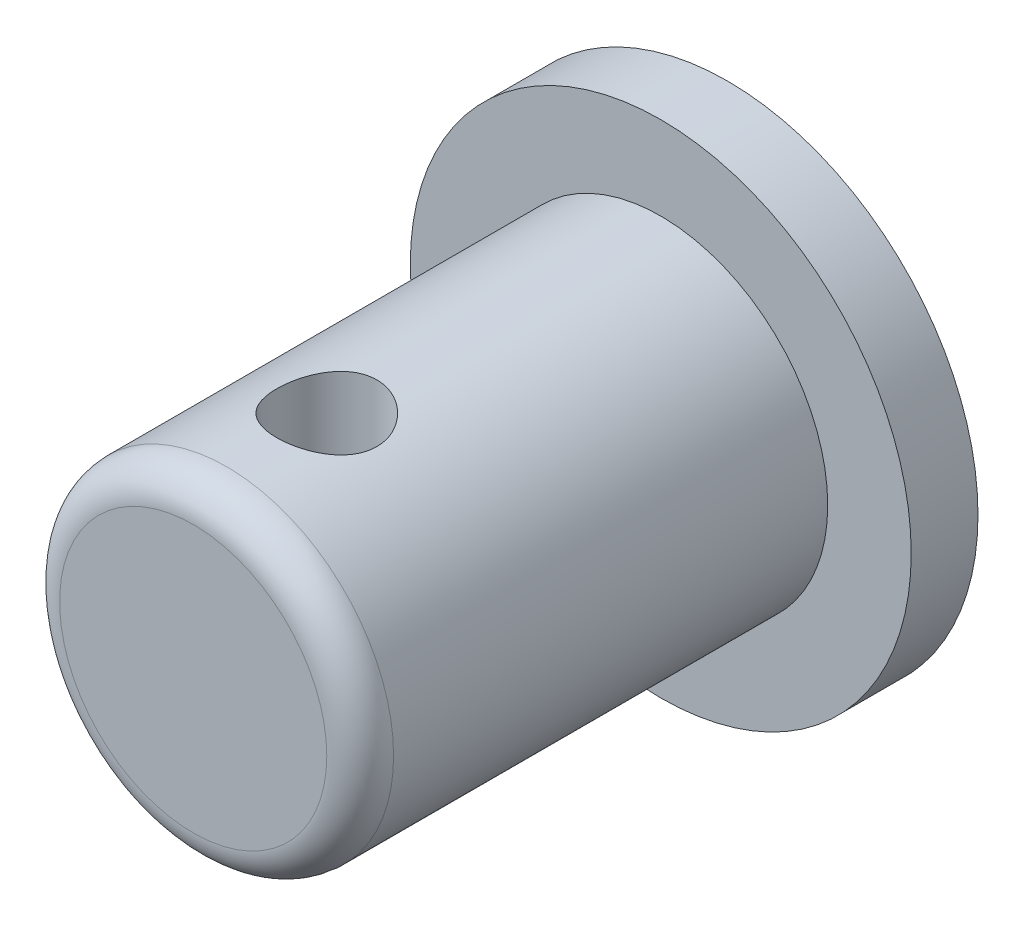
from build123d import *

# Parameters (mm, degrees)
ESQUISSE2_R             = 3.75
BASE_EXTRUSION_DEPTH    = 1
ESQUISSE3_R             = 2.5
BOSS_EXTRU_1_DEPTH      = 7
CONG_1_R                = 0.5
ESQUISSE4_R             = 0.75
ENL_V_MAT_EXTRU_1_DEPTH = 4


with BuildPart() as part:
    # Esquisse2 → Base-Extrusion (new body)
    with BuildSketch(Plane.XY):
        Circle(ESQUISSE2_R)
    extrude(amount=BASE_EXTRUSION_DEPTH)

    # Esquisse3 → Boss.-Extru.1 (add)
    with BuildSketch(Plane.XY.offset(1)):
        Circle(ESQUISSE3_R)
    extrude(amount=BOSS_EXTRU_1_DEPTH)

    # Cong_1
    cong_1_edges = [part.edges().sort_by_distance(p)[0] for p in [
        (-2.5, 0, 8),
    ]]
    fillet(cong_1_edges, radius=CONG_1_R)

    # Esquisse4 → Enl_v. mat.-Extru.1 (cut, symmetric)
    with BuildSketch(Plane(origin=(0, 0, 0), x_dir=(1, 0, 0), z_dir=(0, 1, 0))):
        with Locations(Location((0, -6, 0), (0, 0, 270))):
            Circle(ESQUISSE4_R)
    extrude(amount=ENL_V_MAT_EXTRU_1_DEPTH, both=True, mode=Mode.SUBTRACT)


solid = part.part
